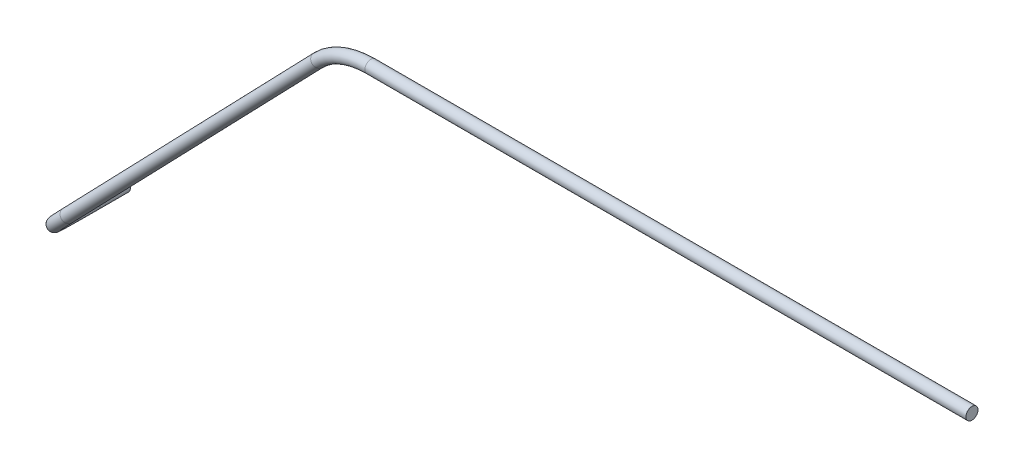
from build123d import *

# Parameters (mm, degrees)
SKETCH1_R = 4.7625


with BuildPart() as part:
    # Sweep1: sweep along a curve in space
    with BuildLine() as sweep1_path:
        Line((0, 25.4, 0), (0, 25.4, 23.819173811))
        ThreePointArc((0, 25.4, 23.819173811), (11.26808476, 37.042762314, 64.828759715), (38.986603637, 65.682955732, 83.689640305))
        Line((38.986603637, 65.682955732, 83.689640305), (257.47955028, 291.441059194, 104.367522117))
        ThreePointArc((257.47955028, 291.441059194, 104.367522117), (277.209923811, 304.966253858, 105.606336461), (300.681024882, 309.7276, 106.042442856))
        Line((300.681024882, 309.7276, 106.042442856), (775.177609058, 309.7276, 106.042442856))
    # Sketch1 → Sweep1 (sweep)
    with BuildSketch(Plane.XY):
        with Locations((0, 25.4)):
            Circle(SKETCH1_R)
    sweep(path=sweep1_path.line)


solid = part.part
